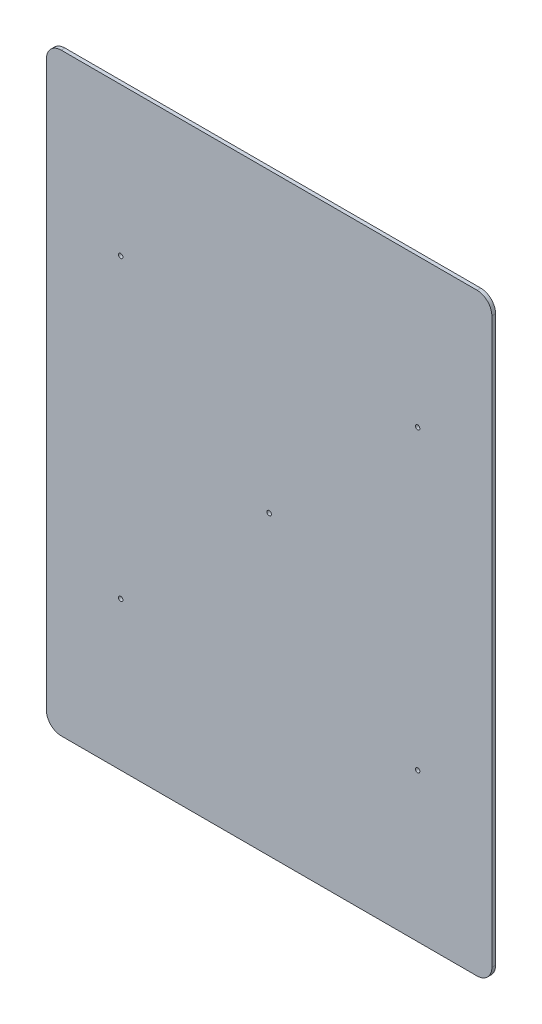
ISO-10303-21;
HEADER;
FILE_DESCRIPTION(('STEP AP214'),'2;1');
FILE_NAME('part.step','',(''),(''),'','','');
FILE_SCHEMA(('AUTOMOTIVE_DESIGN { 1 0 10303 214 1 1 1 1 }'));
ENDSEC;
DATA;
#1=APPLICATION_CONTEXT('core data for automotive mechanical design processes');
#2=APPLICATION_PROTOCOL_DEFINITION('international standard','automotive_design',2000,#1);
#3=PRODUCT_CONTEXT('',#1,'mechanical');
#4=PRODUCT('Part','Part','',(#3));
#5=PRODUCT_RELATED_PRODUCT_CATEGORY('part','',(#4));
#6=PRODUCT_DEFINITION_FORMATION('','',#4);
#7=PRODUCT_DEFINITION_CONTEXT('part definition',#1,'design');
#8=PRODUCT_DEFINITION('design','',#6,#7);
#9=PRODUCT_DEFINITION_SHAPE('','',#8);
#10=(LENGTH_UNIT() NAMED_UNIT(*) SI_UNIT(.MILLI.,.METRE.));
#11=(NAMED_UNIT(*) PLANE_ANGLE_UNIT() SI_UNIT($,.RADIAN.));
#12=(NAMED_UNIT(*) SI_UNIT($,.STERADIAN.) SOLID_ANGLE_UNIT());
#13=UNCERTAINTY_MEASURE_WITH_UNIT(LENGTH_MEASURE(1.E-05),#10,'distance_accuracy_value','');
#14=(GEOMETRIC_REPRESENTATION_CONTEXT(3) GLOBAL_UNCERTAINTY_ASSIGNED_CONTEXT((#13)) GLOBAL_UNIT_ASSIGNED_CONTEXT((#10,
#11,#12)) REPRESENTATION_CONTEXT('',''));
#15=CARTESIAN_POINT('',(0.,0.,0.));
#16=DIRECTION('',(0.,0.,1.));
#17=DIRECTION('',(1.,0.,0.));
#18=AXIS2_PLACEMENT_3D('',#15,#16,#17);
#19=CARTESIAN_POINT('',(0.,0.,5.));
#20=DIRECTION('',(-1.,0.,0.));
#21=DIRECTION('',(0.,0.,1.));
#22=AXIS2_PLACEMENT_3D('',#19,#20,#21);
#23=PLANE('',#22);
#24=DIRECTION('',(0.,1.,0.));
#25=VECTOR('',#24,1.);
#26=CARTESIAN_POINT('',(0.,0.,5.));
#27=LINE('',#26,#25);
#28=CARTESIAN_POINT('',(0.,-780.,5.));
#29=VERTEX_POINT('',#28);
#30=CARTESIAN_POINT('',(0.,-20.,5.));
#31=VERTEX_POINT('',#30);
#32=EDGE_CURVE('E131',#29,#31,#27,.T.);
#33=ORIENTED_EDGE('',*,*,#32,.F.);
#34=DIRECTION('',(0.,0.,-1.));
#35=VECTOR('',#34,1.);
#36=CARTESIAN_POINT('',(0.,-780.,5.));
#37=LINE('',#36,#35);
#38=CARTESIAN_POINT('',(0.,-780.,0.));
#39=VERTEX_POINT('',#38);
#40=EDGE_CURVE('E115',#29,#39,#37,.T.);
#41=ORIENTED_EDGE('',*,*,#40,.T.);
#42=DIRECTION('',(0.,1.,0.));
#43=VECTOR('',#42,1.);
#44=CARTESIAN_POINT('',(0.,0.,0.));
#45=LINE('',#44,#43);
#46=CARTESIAN_POINT('',(0.,-20.,0.));
#47=VERTEX_POINT('',#46);
#48=EDGE_CURVE('E128',#39,#47,#45,.T.);
#49=ORIENTED_EDGE('',*,*,#48,.T.);
#50=DIRECTION('',(0.,0.,-1.));
#51=VECTOR('',#50,1.);
#52=CARTESIAN_POINT('',(0.,-20.,5.));
#53=LINE('',#52,#51);
#54=EDGE_CURVE('E134',#47,#31,#53,.F.);
#55=ORIENTED_EDGE('',*,*,#54,.T.);
#56=EDGE_LOOP('',(#33,#41,#49,#55));
#57=FACE_BOUND('',#56,.T.);
#58=ADVANCED_FACE('F44',(#57),#23,.F.);
#59=CARTESIAN_POINT('',(0.,0.,5.));
#60=DIRECTION('',(0.,-1.,0.));
#61=DIRECTION('',(0.,0.,-1.));
#62=AXIS2_PLACEMENT_3D('',#59,#60,#61);
#63=PLANE('',#62);
#64=DIRECTION('',(-1.,0.,0.));
#65=VECTOR('',#64,1.);
#66=CARTESIAN_POINT('',(0.,0.,0.));
#67=LINE('',#66,#65);
#68=CARTESIAN_POINT('',(-20.,0.,0.));
#69=VERTEX_POINT('',#68);
#70=CARTESIAN_POINT('',(-580.,0.,0.));
#71=VERTEX_POINT('',#70);
#72=EDGE_CURVE('E139',#69,#71,#67,.T.);
#73=ORIENTED_EDGE('',*,*,#72,.T.);
#74=DIRECTION('',(0.,0.,-1.));
#75=VECTOR('',#74,1.);
#76=CARTESIAN_POINT('',(-580.,0.,5.));
#77=LINE('',#76,#75);
#78=CARTESIAN_POINT('',(-580.,0.,5.));
#79=VERTEX_POINT('',#78);
#80=EDGE_CURVE('E11',#71,#79,#77,.F.);
#81=ORIENTED_EDGE('',*,*,#80,.T.);
#82=DIRECTION('',(-1.,0.,0.));
#83=VECTOR('',#82,1.);
#84=CARTESIAN_POINT('',(0.,0.,5.));
#85=LINE('',#84,#83);
#86=CARTESIAN_POINT('',(-20.,0.,5.));
#87=VERTEX_POINT('',#86);
#88=EDGE_CURVE('E196',#87,#79,#85,.T.);
#89=ORIENTED_EDGE('',*,*,#88,.F.);
#90=DIRECTION('',(0.,0.,-1.));
#91=VECTOR('',#90,1.);
#92=CARTESIAN_POINT('',(-20.,0.,5.));
#93=LINE('',#92,#91);
#94=EDGE_CURVE('E53',#87,#69,#93,.T.);
#95=ORIENTED_EDGE('',*,*,#94,.T.);
#96=EDGE_LOOP('',(#73,#81,#89,#95));
#97=FACE_BOUND('',#96,.T.);
#98=ADVANCED_FACE('F194',(#97),#63,.F.);
#99=CARTESIAN_POINT('',(-600.,0.,5.));
#100=DIRECTION('',(1.,0.,0.));
#101=DIRECTION('',(0.,0.,-1.));
#102=AXIS2_PLACEMENT_3D('',#99,#100,#101);
#103=PLANE('',#102);
#104=DIRECTION('',(0.,-1.,0.));
#105=VECTOR('',#104,1.);
#106=CARTESIAN_POINT('',(-600.,0.,0.));
#107=LINE('',#106,#105);
#108=CARTESIAN_POINT('',(-600.,-20.,0.));
#109=VERTEX_POINT('',#108);
#110=CARTESIAN_POINT('',(-600.,-780.,0.));
#111=VERTEX_POINT('',#110);
#112=EDGE_CURVE('E145',#109,#111,#107,.T.);
#113=ORIENTED_EDGE('',*,*,#112,.T.);
#114=DIRECTION('',(0.,0.,-1.));
#115=VECTOR('',#114,1.);
#116=CARTESIAN_POINT('',(-600.,-780.,5.));
#117=LINE('',#116,#115);
#118=CARTESIAN_POINT('',(-600.,-780.,5.));
#119=VERTEX_POINT('',#118);
#120=EDGE_CURVE('E60',#111,#119,#117,.F.);
#121=ORIENTED_EDGE('',*,*,#120,.T.);
#122=DIRECTION('',(0.,-1.,0.));
#123=VECTOR('',#122,1.);
#124=CARTESIAN_POINT('',(-600.,0.,5.));
#125=LINE('',#124,#123);
#126=CARTESIAN_POINT('',(-600.,-20.,5.));
#127=VERTEX_POINT('',#126);
#128=EDGE_CURVE('E204',#127,#119,#125,.T.);
#129=ORIENTED_EDGE('',*,*,#128,.F.);
#130=DIRECTION('',(0.,0.,-1.));
#131=VECTOR('',#130,1.);
#132=CARTESIAN_POINT('',(-600.,-20.,5.));
#133=LINE('',#132,#131);
#134=EDGE_CURVE('E184',#127,#109,#133,.T.);
#135=ORIENTED_EDGE('',*,*,#134,.T.);
#136=EDGE_LOOP('',(#113,#121,#129,#135));
#137=FACE_BOUND('',#136,.T.);
#138=ADVANCED_FACE('F203',(#137),#103,.F.);
#139=CARTESIAN_POINT('',(0.,-800.,5.));
#140=DIRECTION('',(0.,1.,0.));
#141=DIRECTION('',(0.,0.,1.));
#142=AXIS2_PLACEMENT_3D('',#139,#140,#141);
#143=PLANE('',#142);
#144=DIRECTION('',(1.,0.,0.));
#145=VECTOR('',#144,1.);
#146=CARTESIAN_POINT('',(0.,-800.,0.));
#147=LINE('',#146,#145);
#148=CARTESIAN_POINT('',(-580.,-800.,0.));
#149=VERTEX_POINT('',#148);
#150=CARTESIAN_POINT('',(-20.,-800.,0.));
#151=VERTEX_POINT('',#150);
#152=EDGE_CURVE('E156',#149,#151,#147,.T.);
#153=ORIENTED_EDGE('',*,*,#152,.T.);
#154=DIRECTION('',(0.,0.,-1.));
#155=VECTOR('',#154,1.);
#156=CARTESIAN_POINT('',(-20.,-800.,5.));
#157=LINE('',#156,#155);
#158=CARTESIAN_POINT('',(-20.,-800.,5.));
#159=VERTEX_POINT('',#158);
#160=EDGE_CURVE('E116',#151,#159,#157,.F.);
#161=ORIENTED_EDGE('',*,*,#160,.T.);
#162=DIRECTION('',(1.,0.,0.));
#163=VECTOR('',#162,1.);
#164=CARTESIAN_POINT('',(0.,-800.,5.));
#165=LINE('',#164,#163);
#166=CARTESIAN_POINT('',(-580.,-800.,5.));
#167=VERTEX_POINT('',#166);
#168=EDGE_CURVE('E151',#167,#159,#165,.T.);
#169=ORIENTED_EDGE('',*,*,#168,.F.);
#170=DIRECTION('',(0.,0.,-1.));
#171=VECTOR('',#170,1.);
#172=CARTESIAN_POINT('',(-580.,-800.,5.));
#173=LINE('',#172,#171);
#174=EDGE_CURVE('E122',#167,#149,#173,.T.);
#175=ORIENTED_EDGE('',*,*,#174,.T.);
#176=EDGE_LOOP('',(#153,#161,#169,#175));
#177=FACE_BOUND('',#176,.T.);
#178=ADVANCED_FACE('F302',(#177),#143,.F.);
#179=CARTESIAN_POINT('',(0.,0.,5.));
#180=DIRECTION('',(0.,0.,-1.));
#181=DIRECTION('',(-1.,0.,0.));
#182=AXIS2_PLACEMENT_3D('',#179,#180,#181);
#183=PLANE('',#182);
#184=CARTESIAN_POINT('',(-500.00000000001,-599.999999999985,5.));
#185=DIRECTION('',(0.,0.,-1.));
#186=DIRECTION('',(-1.,0.,0.));
#187=AXIS2_PLACEMENT_3D('',#184,#185,#186);
#188=CIRCLE('',#187,2.99999999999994);
#189=CARTESIAN_POINT('',(-503.00000000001,-599.999999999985,5.));
#190=VERTEX_POINT('',#189);
#191=EDGE_CURVE('E218',#190,#190,#188,.T.);
#192=ORIENTED_EDGE('',*,*,#191,.T.);
#193=EDGE_LOOP('',(#192));
#194=FACE_BOUND('',#193,.T.);
#195=CARTESIAN_POINT('',(-500.000000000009,-199.999999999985,5.));
#196=DIRECTION('',(0.,0.,-1.));
#197=DIRECTION('',(-1.,0.,0.));
#198=AXIS2_PLACEMENT_3D('',#195,#196,#197);
#199=CIRCLE('',#198,3.00000000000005);
#200=CARTESIAN_POINT('',(-503.000000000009,-199.999999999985,5.));
#201=VERTEX_POINT('',#200);
#202=EDGE_CURVE('E226',#201,#201,#199,.T.);
#203=ORIENTED_EDGE('',*,*,#202,.T.);
#204=EDGE_LOOP('',(#203));
#205=FACE_BOUND('',#204,.T.);
#206=CARTESIAN_POINT('',(-100.000000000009,-199.999999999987,5.));
#207=DIRECTION('',(0.,0.,-1.));
#208=DIRECTION('',(-1.,0.,0.));
#209=AXIS2_PLACEMENT_3D('',#206,#207,#208);
#210=CIRCLE('',#209,3.00000000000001);
#211=CARTESIAN_POINT('',(-103.000000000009,-199.999999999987,5.));
#212=VERTEX_POINT('',#211);
#213=EDGE_CURVE('E234',#212,#212,#210,.T.);
#214=ORIENTED_EDGE('',*,*,#213,.T.);
#215=EDGE_LOOP('',(#214));
#216=FACE_BOUND('',#215,.T.);
#217=CARTESIAN_POINT('',(-300.000000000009,-399.999999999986,5.));
#218=DIRECTION('',(0.,0.,-1.));
#219=DIRECTION('',(-1.,0.,0.));
#220=AXIS2_PLACEMENT_3D('',#217,#218,#219);
#221=CIRCLE('',#220,2.99999999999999);
#222=CARTESIAN_POINT('',(-303.000000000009,-399.999999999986,5.));
#223=VERTEX_POINT('',#222);
#224=EDGE_CURVE('E242',#223,#223,#221,.T.);
#225=ORIENTED_EDGE('',*,*,#224,.T.);
#226=EDGE_LOOP('',(#225));
#227=FACE_BOUND('',#226,.T.);
#228=CARTESIAN_POINT('',(-100.00000000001,-599.999999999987,5.));
#229=DIRECTION('',(0.,0.,-1.));
#230=DIRECTION('',(-1.,0.,0.));
#231=AXIS2_PLACEMENT_3D('',#228,#229,#230);
#232=CIRCLE('',#231,3.00000000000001);
#233=CARTESIAN_POINT('',(-103.00000000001,-599.999999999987,5.));
#234=VERTEX_POINT('',#233);
#235=EDGE_CURVE('E140',#234,#234,#232,.T.);
#236=ORIENTED_EDGE('',*,*,#235,.T.);
#237=EDGE_LOOP('',(#236));
#238=FACE_BOUND('',#237,.T.);
#239=ORIENTED_EDGE('',*,*,#168,.T.);
#240=CARTESIAN_POINT('',(-20.,-780.,5.));
#241=DIRECTION('',(0.,0.,-1.));
#242=DIRECTION('',(-1.,0.,0.));
#243=AXIS2_PLACEMENT_3D('',#240,#241,#242);
#244=CIRCLE('',#243,20.);
#245=EDGE_CURVE('E181',#159,#29,#244,.F.);
#246=ORIENTED_EDGE('',*,*,#245,.T.);
#247=ORIENTED_EDGE('',*,*,#32,.T.);
#248=CARTESIAN_POINT('',(-20.,-20.,5.));
#249=DIRECTION('',(0.,0.,-1.));
#250=DIRECTION('',(-1.,0.,0.));
#251=AXIS2_PLACEMENT_3D('',#248,#249,#250);
#252=CIRCLE('',#251,20.);
#253=EDGE_CURVE('E173',#31,#87,#252,.F.);
#254=ORIENTED_EDGE('',*,*,#253,.T.);
#255=ORIENTED_EDGE('',*,*,#88,.T.);
#256=CARTESIAN_POINT('',(-580.,-20.,5.));
#257=DIRECTION('',(0.,0.,-1.));
#258=DIRECTION('',(-1.,0.,0.));
#259=AXIS2_PLACEMENT_3D('',#256,#257,#258);
#260=CIRCLE('',#259,20.);
#261=EDGE_CURVE('E67',#79,#127,#260,.F.);
#262=ORIENTED_EDGE('',*,*,#261,.T.);
#263=ORIENTED_EDGE('',*,*,#128,.T.);
#264=CARTESIAN_POINT('',(-580.,-780.,5.));
#265=DIRECTION('',(0.,0.,-1.));
#266=DIRECTION('',(-1.,0.,0.));
#267=AXIS2_PLACEMENT_3D('',#264,#265,#266);
#268=CIRCLE('',#267,20.);
#269=EDGE_CURVE('E178',#119,#167,#268,.F.);
#270=ORIENTED_EDGE('',*,*,#269,.T.);
#271=EDGE_LOOP('',(#239,#246,#247,#254,#255,#262,#263,#270));
#272=FACE_BOUND('',#271,.T.);
#273=ADVANCED_FACE('F254',(#194,#205,#216,#227,#238,#272),#183,.F.);
#274=CARTESIAN_POINT('',(0.,0.,0.));
#275=DIRECTION('',(0.,0.,-1.));
#276=DIRECTION('',(-1.,0.,0.));
#277=AXIS2_PLACEMENT_3D('',#274,#275,#276);
#278=PLANE('',#277);
#279=CARTESIAN_POINT('',(-500.00000000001,-599.999999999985,0.));
#280=DIRECTION('',(0.,0.,-1.));
#281=DIRECTION('',(-1.,0.,0.));
#282=AXIS2_PLACEMENT_3D('',#279,#280,#281);
#283=CIRCLE('',#282,2.99999999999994);
#284=CARTESIAN_POINT('',(-503.00000000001,-599.999999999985,0.));
#285=VERTEX_POINT('',#284);
#286=EDGE_CURVE('E222',#285,#285,#283,.T.);
#287=ORIENTED_EDGE('',*,*,#286,.F.);
#288=EDGE_LOOP('',(#287));
#289=FACE_BOUND('',#288,.T.);
#290=CARTESIAN_POINT('',(-500.000000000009,-199.999999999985,0.));
#291=DIRECTION('',(0.,0.,-1.));
#292=DIRECTION('',(-1.,0.,0.));
#293=AXIS2_PLACEMENT_3D('',#290,#291,#292);
#294=CIRCLE('',#293,3.00000000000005);
#295=CARTESIAN_POINT('',(-503.000000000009,-199.999999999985,0.));
#296=VERTEX_POINT('',#295);
#297=EDGE_CURVE('E230',#296,#296,#294,.T.);
#298=ORIENTED_EDGE('',*,*,#297,.F.);
#299=EDGE_LOOP('',(#298));
#300=FACE_BOUND('',#299,.T.);
#301=CARTESIAN_POINT('',(-100.000000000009,-199.999999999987,0.));
#302=DIRECTION('',(0.,0.,-1.));
#303=DIRECTION('',(-1.,0.,0.));
#304=AXIS2_PLACEMENT_3D('',#301,#302,#303);
#305=CIRCLE('',#304,3.00000000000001);
#306=CARTESIAN_POINT('',(-103.000000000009,-199.999999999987,0.));
#307=VERTEX_POINT('',#306);
#308=EDGE_CURVE('E238',#307,#307,#305,.T.);
#309=ORIENTED_EDGE('',*,*,#308,.F.);
#310=EDGE_LOOP('',(#309));
#311=FACE_BOUND('',#310,.T.);
#312=CARTESIAN_POINT('',(-300.000000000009,-399.999999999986,0.));
#313=DIRECTION('',(0.,0.,-1.));
#314=DIRECTION('',(-1.,0.,0.));
#315=AXIS2_PLACEMENT_3D('',#312,#313,#314);
#316=CIRCLE('',#315,2.99999999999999);
#317=CARTESIAN_POINT('',(-303.000000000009,-399.999999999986,0.));
#318=VERTEX_POINT('',#317);
#319=EDGE_CURVE('E216',#318,#318,#316,.T.);
#320=ORIENTED_EDGE('',*,*,#319,.F.);
#321=EDGE_LOOP('',(#320));
#322=FACE_BOUND('',#321,.T.);
#323=CARTESIAN_POINT('',(-100.00000000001,-599.999999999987,0.));
#324=DIRECTION('',(0.,0.,-1.));
#325=DIRECTION('',(-1.,0.,0.));
#326=AXIS2_PLACEMENT_3D('',#323,#324,#325);
#327=CIRCLE('',#326,3.00000000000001);
#328=CARTESIAN_POINT('',(-103.00000000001,-599.999999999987,0.));
#329=VERTEX_POINT('',#328);
#330=EDGE_CURVE('E148',#329,#329,#327,.T.);
#331=ORIENTED_EDGE('',*,*,#330,.F.);
#332=EDGE_LOOP('',(#331));
#333=FACE_BOUND('',#332,.T.);
#334=ORIENTED_EDGE('',*,*,#48,.F.);
#335=CARTESIAN_POINT('',(-20.,-780.,0.));
#336=DIRECTION('',(0.,0.,-1.));
#337=DIRECTION('',(-1.,0.,0.));
#338=AXIS2_PLACEMENT_3D('',#335,#336,#337);
#339=CIRCLE('',#338,20.);
#340=EDGE_CURVE('E111',#39,#151,#339,.T.);
#341=ORIENTED_EDGE('',*,*,#340,.T.);
#342=ORIENTED_EDGE('',*,*,#152,.F.);
#343=CARTESIAN_POINT('',(-580.,-780.,0.));
#344=DIRECTION('',(0.,0.,-1.));
#345=DIRECTION('',(-1.,0.,0.));
#346=AXIS2_PLACEMENT_3D('',#343,#344,#345);
#347=CIRCLE('',#346,20.);
#348=EDGE_CURVE('E123',#149,#111,#347,.T.);
#349=ORIENTED_EDGE('',*,*,#348,.T.);
#350=ORIENTED_EDGE('',*,*,#112,.F.);
#351=CARTESIAN_POINT('',(-580.,-20.,0.));
#352=DIRECTION('',(0.,0.,-1.));
#353=DIRECTION('',(-1.,0.,0.));
#354=AXIS2_PLACEMENT_3D('',#351,#352,#353);
#355=CIRCLE('',#354,20.);
#356=EDGE_CURVE('E163',#109,#71,#355,.T.);
#357=ORIENTED_EDGE('',*,*,#356,.T.);
#358=ORIENTED_EDGE('',*,*,#72,.F.);
#359=CARTESIAN_POINT('',(-20.,-20.,0.));
#360=DIRECTION('',(0.,0.,-1.));
#361=DIRECTION('',(-1.,0.,0.));
#362=AXIS2_PLACEMENT_3D('',#359,#360,#361);
#363=CIRCLE('',#362,20.);
#364=EDGE_CURVE('E133',#69,#47,#363,.T.);
#365=ORIENTED_EDGE('',*,*,#364,.T.);
#366=EDGE_LOOP('',(#334,#341,#342,#349,#350,#357,#358,#365));
#367=FACE_BOUND('',#366,.T.);
#368=ADVANCED_FACE('F136',(#289,#300,#311,#322,#333,#367),#278,.T.);
#369=CARTESIAN_POINT('',(-20.,-780.,5.));
#370=DIRECTION('',(0.,0.,-1.));
#371=DIRECTION('',(-1.,0.,0.));
#372=AXIS2_PLACEMENT_3D('',#369,#370,#371);
#373=CYLINDRICAL_SURFACE('',#372,20.);
#374=ORIENTED_EDGE('',*,*,#245,.F.);
#375=ORIENTED_EDGE('',*,*,#160,.F.);
#376=ORIENTED_EDGE('',*,*,#340,.F.);
#377=ORIENTED_EDGE('',*,*,#40,.F.);
#378=EDGE_LOOP('',(#374,#375,#376,#377));
#379=FACE_BOUND('',#378,.T.);
#380=ADVANCED_FACE('F114',(#379),#373,.T.);
#381=CARTESIAN_POINT('',(-580.,-780.,5.));
#382=DIRECTION('',(0.,0.,-1.));
#383=DIRECTION('',(-1.,0.,0.));
#384=AXIS2_PLACEMENT_3D('',#381,#382,#383);
#385=CYLINDRICAL_SURFACE('',#384,20.);
#386=ORIENTED_EDGE('',*,*,#269,.F.);
#387=ORIENTED_EDGE('',*,*,#120,.F.);
#388=ORIENTED_EDGE('',*,*,#348,.F.);
#389=ORIENTED_EDGE('',*,*,#174,.F.);
#390=EDGE_LOOP('',(#386,#387,#388,#389));
#391=FACE_BOUND('',#390,.T.);
#392=ADVANCED_FACE('F283',(#391),#385,.T.);
#393=CARTESIAN_POINT('',(-580.,-20.,5.));
#394=DIRECTION('',(0.,0.,-1.));
#395=DIRECTION('',(-1.,0.,0.));
#396=AXIS2_PLACEMENT_3D('',#393,#394,#395);
#397=CYLINDRICAL_SURFACE('',#396,20.);
#398=ORIENTED_EDGE('',*,*,#261,.F.);
#399=ORIENTED_EDGE('',*,*,#80,.F.);
#400=ORIENTED_EDGE('',*,*,#356,.F.);
#401=ORIENTED_EDGE('',*,*,#134,.F.);
#402=EDGE_LOOP('',(#398,#399,#400,#401));
#403=FACE_BOUND('',#402,.T.);
#404=ADVANCED_FACE('F202',(#403),#397,.T.);
#405=CARTESIAN_POINT('',(-20.,-20.,5.));
#406=DIRECTION('',(0.,0.,-1.));
#407=DIRECTION('',(-1.,0.,0.));
#408=AXIS2_PLACEMENT_3D('',#405,#406,#407);
#409=CYLINDRICAL_SURFACE('',#408,20.);
#410=ORIENTED_EDGE('',*,*,#253,.F.);
#411=ORIENTED_EDGE('',*,*,#54,.F.);
#412=ORIENTED_EDGE('',*,*,#364,.F.);
#413=ORIENTED_EDGE('',*,*,#94,.F.);
#414=EDGE_LOOP('',(#410,#411,#412,#413));
#415=FACE_BOUND('',#414,.T.);
#416=ADVANCED_FACE('F46',(#415),#409,.T.);
#417=CARTESIAN_POINT('',(-100.00000000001,-599.999999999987,5.));
#418=DIRECTION('',(0.,0.,-1.));
#419=DIRECTION('',(-1.,0.,0.));
#420=AXIS2_PLACEMENT_3D('',#417,#418,#419);
#421=CYLINDRICAL_SURFACE('',#420,3.00000000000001);
#422=ORIENTED_EDGE('',*,*,#235,.F.);
#423=EDGE_LOOP('',(#422));
#424=FACE_BOUND('',#423,.T.);
#425=ORIENTED_EDGE('',*,*,#330,.T.);
#426=EDGE_LOOP('',(#425));
#427=FACE_BOUND('',#426,.T.);
#428=ADVANCED_FACE('F259',(#424,#427),#421,.F.);
#429=CARTESIAN_POINT('',(-300.000000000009,-399.999999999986,5.));
#430=DIRECTION('',(0.,0.,-1.));
#431=DIRECTION('',(-1.,0.,0.));
#432=AXIS2_PLACEMENT_3D('',#429,#430,#431);
#433=CYLINDRICAL_SURFACE('',#432,2.99999999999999);
#434=ORIENTED_EDGE('',*,*,#224,.F.);
#435=EDGE_LOOP('',(#434));
#436=FACE_BOUND('',#435,.T.);
#437=ORIENTED_EDGE('',*,*,#319,.T.);
#438=EDGE_LOOP('',(#437));
#439=FACE_BOUND('',#438,.T.);
#440=ADVANCED_FACE('F250',(#436,#439),#433,.F.);
#441=CARTESIAN_POINT('',(-100.000000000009,-199.999999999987,5.));
#442=DIRECTION('',(0.,0.,-1.));
#443=DIRECTION('',(-1.,0.,0.));
#444=AXIS2_PLACEMENT_3D('',#441,#442,#443);
#445=CYLINDRICAL_SURFACE('',#444,3.00000000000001);
#446=ORIENTED_EDGE('',*,*,#213,.F.);
#447=EDGE_LOOP('',(#446));
#448=FACE_BOUND('',#447,.T.);
#449=ORIENTED_EDGE('',*,*,#308,.T.);
#450=EDGE_LOOP('',(#449));
#451=FACE_BOUND('',#450,.T.);
#452=ADVANCED_FACE('F266',(#448,#451),#445,.F.);
#453=CARTESIAN_POINT('',(-500.000000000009,-199.999999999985,5.));
#454=DIRECTION('',(0.,0.,-1.));
#455=DIRECTION('',(-1.,0.,0.));
#456=AXIS2_PLACEMENT_3D('',#453,#454,#455);
#457=CYLINDRICAL_SURFACE('',#456,3.00000000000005);
#458=ORIENTED_EDGE('',*,*,#202,.F.);
#459=EDGE_LOOP('',(#458));
#460=FACE_BOUND('',#459,.T.);
#461=ORIENTED_EDGE('',*,*,#297,.T.);
#462=EDGE_LOOP('',(#461));
#463=FACE_BOUND('',#462,.T.);
#464=ADVANCED_FACE('F341',(#460,#463),#457,.F.);
#465=CARTESIAN_POINT('',(-500.00000000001,-599.999999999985,5.));
#466=DIRECTION('',(0.,0.,-1.));
#467=DIRECTION('',(-1.,0.,0.));
#468=AXIS2_PLACEMENT_3D('',#465,#466,#467);
#469=CYLINDRICAL_SURFACE('',#468,2.99999999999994);
#470=ORIENTED_EDGE('',*,*,#191,.F.);
#471=EDGE_LOOP('',(#470));
#472=FACE_BOUND('',#471,.T.);
#473=ORIENTED_EDGE('',*,*,#286,.T.);
#474=EDGE_LOOP('',(#473));
#475=FACE_BOUND('',#474,.T.);
#476=ADVANCED_FACE('F350',(#472,#475),#469,.F.);
#477=CLOSED_SHELL('',(#58,#98,#138,#178,#273,#368,#380,#392,#404,#416,#428,#440,#452,#464,#476));
#478=MANIFOLD_SOLID_BREP('B2',#477);
#479=ADVANCED_BREP_SHAPE_REPRESENTATION('',(#18,#478),#14);
#480=SHAPE_DEFINITION_REPRESENTATION(#9,#479);
ENDSEC;
END-ISO-10303-21;
